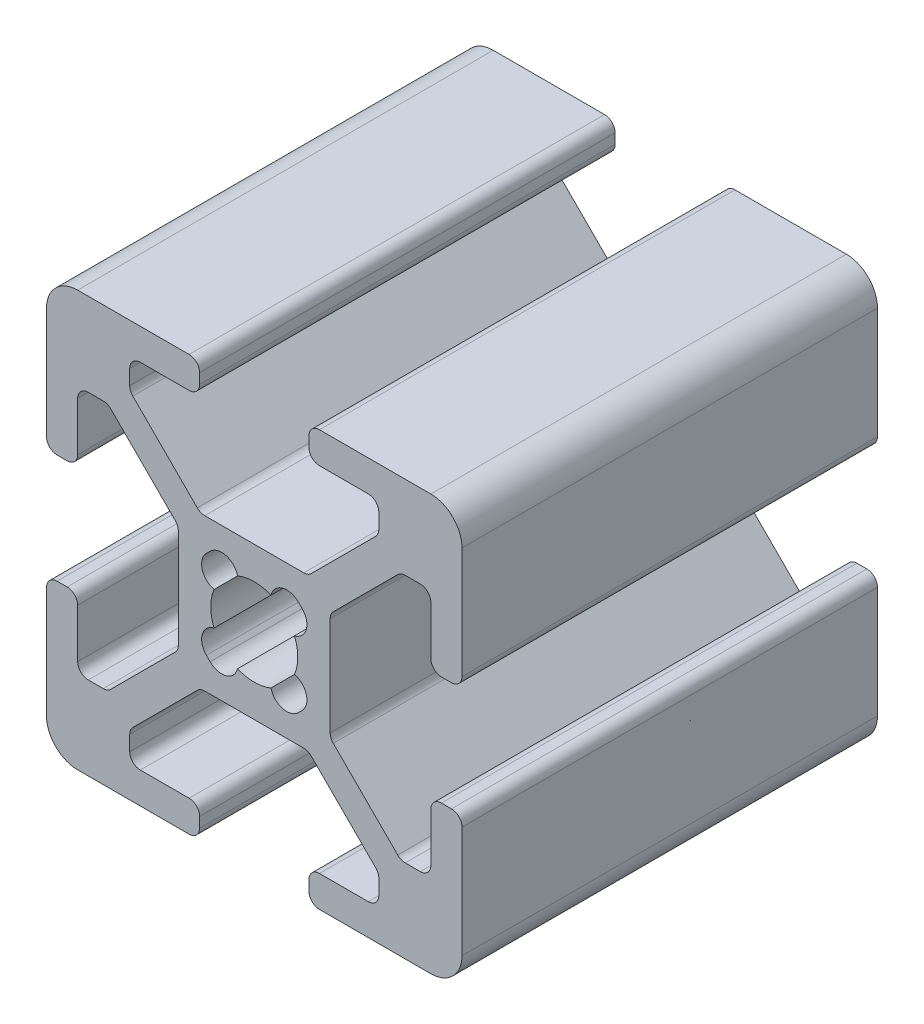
from build123d import *

# Parameters (mm, degrees)
BOSS_EXTRUDE1_DEPTH = 20


with BuildPart() as part:
    # Sketch1 → Boss-Extrude1 (new body)
    with BuildSketch(Plane.XY):
        with BuildLine():
            Line((-5.032287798, -0.341059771), (-5.516287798, -0.341059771))
            ThreePointArc((-5.516287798, -0.341059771), (-5.875498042, -0.192270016), (-6.024287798, 0.166940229))
            Line((-6.024287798, 0.166940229), (-6.024287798, 2.515940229))
            ThreePointArc((-6.024287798, 2.515940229), (-6.173077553, 2.875150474), (-6.532287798, 3.023940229))
            Line((-6.532287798, 3.023940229), (-7.258207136, 3.023940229))
            ThreePointArc((-7.258207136, 3.023940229), (-7.45261032, 2.985271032), (-7.617417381, 2.875150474))
            Line((-7.617417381, 2.875150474), (-10.720498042, -0.227930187))
            ThreePointArc((-10.720498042, -0.227930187), (-10.8306186, -0.392737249), (-10.869287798, -0.587140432))
            Line((-10.869287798, -0.587140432), (-10.869287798, -5.354979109))
            ThreePointArc((-10.869287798, -5.354979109), (-10.8306186, -5.549382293), (-10.720498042, -5.714189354))
            Line((-10.720498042, -5.714189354), (-7.617417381, -8.817270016))
            ThreePointArc((-7.617417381, -8.817270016), (-7.45261032, -8.927390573), (-7.258207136, -8.966059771))
            Line((-7.258207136, -8.966059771), (-6.532287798, -8.966059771))
            ThreePointArc((-6.532287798, -8.966059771), (-6.173077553, -8.817270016), (-6.024287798, -8.458059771))
            Line((-6.024287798, -8.458059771), (-6.024287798, -6.109059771))
            ThreePointArc((-6.024287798, -6.109059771), (-5.875498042, -5.749849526), (-5.516287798, -5.601059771))
            Line((-5.516287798, -5.601059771), (-5.032287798, -5.601059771))
            ThreePointArc((-5.032287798, -5.601059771), (-4.673077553, -5.749849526), (-4.524287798, -6.109059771))
            Line((-4.524287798, -6.109059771), (-4.524287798, -11.471059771))
            ThreePointArc((-4.524287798, -11.471059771), (-4.963627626, -12.531719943), (-6.024287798, -12.971059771))
            Line((-6.024287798, -12.971059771), (-11.386287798, -12.971059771))
            ThreePointArc((-11.386287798, -12.971059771), (-11.745498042, -12.822270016), (-11.894287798, -12.463059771))
            Line((-11.894287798, -12.463059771), (-11.894287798, -11.979059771))
            ThreePointArc((-11.894287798, -11.979059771), (-11.745498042, -11.619849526), (-11.386287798, -11.471059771))
            Line((-11.386287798, -11.471059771), (-9.037287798, -11.471059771))
            ThreePointArc((-9.037287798, -11.471059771), (-8.678077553, -11.322270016), (-8.529287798, -10.963059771))
            Line((-8.529287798, -10.963059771), (-8.529287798, -10.237140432))
            ThreePointArc((-8.529287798, -10.237140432), (-8.567956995, -10.042737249), (-8.678077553, -9.877930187))
            Line((-8.678077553, -9.877930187), (-11.781158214, -6.774849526))
            ThreePointArc((-11.781158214, -6.774849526), (-11.945965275, -6.664728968), (-12.140368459, -6.626059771))
            Line((-12.140368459, -6.626059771), (-16.908207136, -6.626059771))
            ThreePointArc((-16.908207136, -6.626059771), (-17.10261032, -6.664728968), (-17.267417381, -6.774849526))
            Line((-17.267417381, -6.774849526), (-20.370498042, -9.877930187))
            ThreePointArc((-20.370498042, -9.877930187), (-20.4806186, -10.042737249), (-20.519287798, -10.237140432))
            Line((-20.519287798, -10.237140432), (-20.519287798, -10.963059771))
            ThreePointArc((-20.519287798, -10.963059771), (-20.370498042, -11.322270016), (-20.011287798, -11.471059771))
            Line((-20.011287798, -11.471059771), (-17.662287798, -11.471059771))
            ThreePointArc((-17.662287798, -11.471059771), (-17.303077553, -11.619849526), (-17.154287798, -11.979059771))
            Line((-17.154287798, -11.979059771), (-17.154287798, -12.463059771))
            ThreePointArc((-17.154287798, -12.463059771), (-17.303077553, -12.822270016), (-17.662287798, -12.971059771))
            Line((-17.662287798, -12.971059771), (-23.024287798, -12.971059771))
            ThreePointArc((-23.024287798, -12.971059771), (-24.084947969, -12.531719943), (-24.524287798, -11.471059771))
            Line((-24.524287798, -11.471059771), (-24.524287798, -6.109059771))
            ThreePointArc((-24.524287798, -6.109059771), (-24.375498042, -5.749849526), (-24.016287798, -5.601059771))
            Line((-24.016287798, -5.601059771), (-23.532287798, -5.601059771))
            ThreePointArc((-23.532287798, -5.601059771), (-23.173077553, -5.749849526), (-23.024287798, -6.109059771))
            Line((-23.024287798, -6.109059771), (-23.024287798, -8.458059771))
            ThreePointArc((-23.024287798, -8.458059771), (-22.875498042, -8.817270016), (-22.516287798, -8.966059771))
            Line((-22.516287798, -8.966059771), (-21.790368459, -8.966059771))
            ThreePointArc((-21.790368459, -8.966059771), (-21.595965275, -8.927390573), (-21.431158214, -8.817270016))
            Line((-21.431158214, -8.817270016), (-18.328077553, -5.714189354))
            ThreePointArc((-18.328077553, -5.714189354), (-18.217956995, -5.549382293), (-18.179287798, -5.354979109))
            Line((-18.179287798, -5.354979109), (-18.179287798, -0.587140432))
            ThreePointArc((-18.179287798, -0.587140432), (-18.217956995, -0.392737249), (-18.328077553, -0.227930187))
            Line((-18.328077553, -0.227930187), (-21.431158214, 2.875150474))
            ThreePointArc((-21.431158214, 2.875150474), (-21.595965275, 2.985271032), (-21.790368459, 3.023940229))
            Line((-21.790368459, 3.023940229), (-22.516287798, 3.023940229))
            ThreePointArc((-22.516287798, 3.023940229), (-22.875498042, 2.875150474), (-23.024287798, 2.515940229))
            Line((-23.024287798, 2.515940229), (-23.024287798, 0.166940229))
            ThreePointArc((-23.024287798, 0.166940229), (-23.173077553, -0.192270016), (-23.532287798, -0.341059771))
            Line((-23.532287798, -0.341059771), (-24.016287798, -0.341059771))
            ThreePointArc((-24.016287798, -0.341059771), (-24.375498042, -0.192270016), (-24.524287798, 0.166940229))
            Line((-24.524287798, 0.166940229), (-24.524287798, 5.528940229))
            ThreePointArc((-24.524287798, 5.528940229), (-24.084947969, 6.589600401), (-23.024287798, 7.028940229))
            Line((-23.024287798, 7.028940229), (-17.662287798, 7.028940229))
            ThreePointArc((-17.662287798, 7.028940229), (-17.303077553, 6.880150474), (-17.154287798, 6.520940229))
            Line((-17.154287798, 6.520940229), (-17.154287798, 6.036940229))
            ThreePointArc((-17.154287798, 6.036940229), (-17.303077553, 5.677729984), (-17.662287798, 5.528940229))
            Line((-17.662287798, 5.528940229), (-20.011287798, 5.528940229))
            ThreePointArc((-20.011287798, 5.528940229), (-20.370498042, 5.380150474), (-20.519287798, 5.020940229))
            Line((-20.519287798, 5.020940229), (-20.519287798, 4.295020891))
            ThreePointArc((-20.519287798, 4.295020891), (-20.4806186, 4.100617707), (-20.370498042, 3.935810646))
            Line((-20.370498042, 3.935810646), (-17.267417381, 0.832729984))
            ThreePointArc((-17.267417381, 0.832729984), (-17.10261032, 0.722609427), (-16.908207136, 0.683940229))
            Line((-16.908207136, 0.683940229), (-12.140368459, 0.683940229))
            ThreePointArc((-12.140368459, 0.683940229), (-11.945965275, 0.722609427), (-11.781158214, 0.832729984))
            Line((-11.781158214, 0.832729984), (-8.678077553, 3.935810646))
            ThreePointArc((-8.678077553, 3.935810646), (-8.567956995, 4.100617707), (-8.529287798, 4.295020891))
            Line((-8.529287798, 4.295020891), (-8.529287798, 5.020940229))
            ThreePointArc((-8.529287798, 5.020940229), (-8.678077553, 5.380150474), (-9.037287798, 5.528940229))
            Line((-9.037287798, 5.528940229), (-11.386287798, 5.528940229))
            ThreePointArc((-11.386287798, 5.528940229), (-11.745498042, 5.677729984), (-11.894287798, 6.036940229))
            Line((-11.894287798, 6.036940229), (-11.894287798, 6.520940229))
            ThreePointArc((-11.894287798, 6.520940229), (-11.745498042, 6.880150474), (-11.386287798, 7.028940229))
            Line((-11.386287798, 7.028940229), (-6.024287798, 7.028940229))
            ThreePointArc((-6.024287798, 7.028940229), (-4.963627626, 6.589600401), (-4.524287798, 5.528940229))
            Line((-4.524287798, 5.528940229), (-4.524287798, 0.166940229))
            ThreePointArc((-4.524287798, 0.166940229), (-4.673077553, -0.192270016), (-5.032287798, -0.341059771))
        make_face()
        with BuildLine():
            Line((-12.399386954, -5.275565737), (-12.219781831, -5.095960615))
            ThreePointArc((-12.219781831, -5.095960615), (-12.018349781, -4.327527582), (-12.589154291, -3.775036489))
            ThreePointArc((-12.589154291, -3.775036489), (-12.428787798, -2.971059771), (-12.589154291, -2.167083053))
            ThreePointArc((-12.589154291, -2.167083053), (-12.018349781, -1.61459196), (-12.219781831, -0.846158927))
            Line((-12.219781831, -0.846158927), (-12.399386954, -0.666553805))
            ThreePointArc((-12.399386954, -0.666553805), (-13.167819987, -0.465121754), (-13.72031108, -1.035926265))
            ThreePointArc((-13.72031108, -1.035926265), (-14.524287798, -0.875559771), (-15.328264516, -1.035926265))
            ThreePointArc((-15.328264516, -1.035926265), (-15.880755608, -0.465121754), (-16.649188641, -0.666553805))
            Line((-16.649188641, -0.666553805), (-16.828793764, -0.846158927))
            ThreePointArc((-16.828793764, -0.846158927), (-17.030225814, -1.61459196), (-16.459421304, -2.167083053))
            ThreePointArc((-16.459421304, -2.167083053), (-16.619787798, -2.971059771), (-16.459421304, -3.775036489))
            ThreePointArc((-16.459421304, -3.775036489), (-17.030225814, -4.327527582), (-16.828793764, -5.095960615))
            Line((-16.828793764, -5.095960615), (-16.649188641, -5.275565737))
            ThreePointArc((-16.649188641, -5.275565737), (-15.880755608, -5.476997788), (-15.328264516, -4.906193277))
            ThreePointArc((-15.328264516, -4.906193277), (-14.524287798, -5.066559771), (-13.72031108, -4.906193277))
            ThreePointArc((-13.72031108, -4.906193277), (-13.167819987, -5.476997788), (-12.399386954, -5.275565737))
        make_face(mode=Mode.SUBTRACT)
    extrude(amount=BOSS_EXTRUDE1_DEPTH)


solid = part.part
